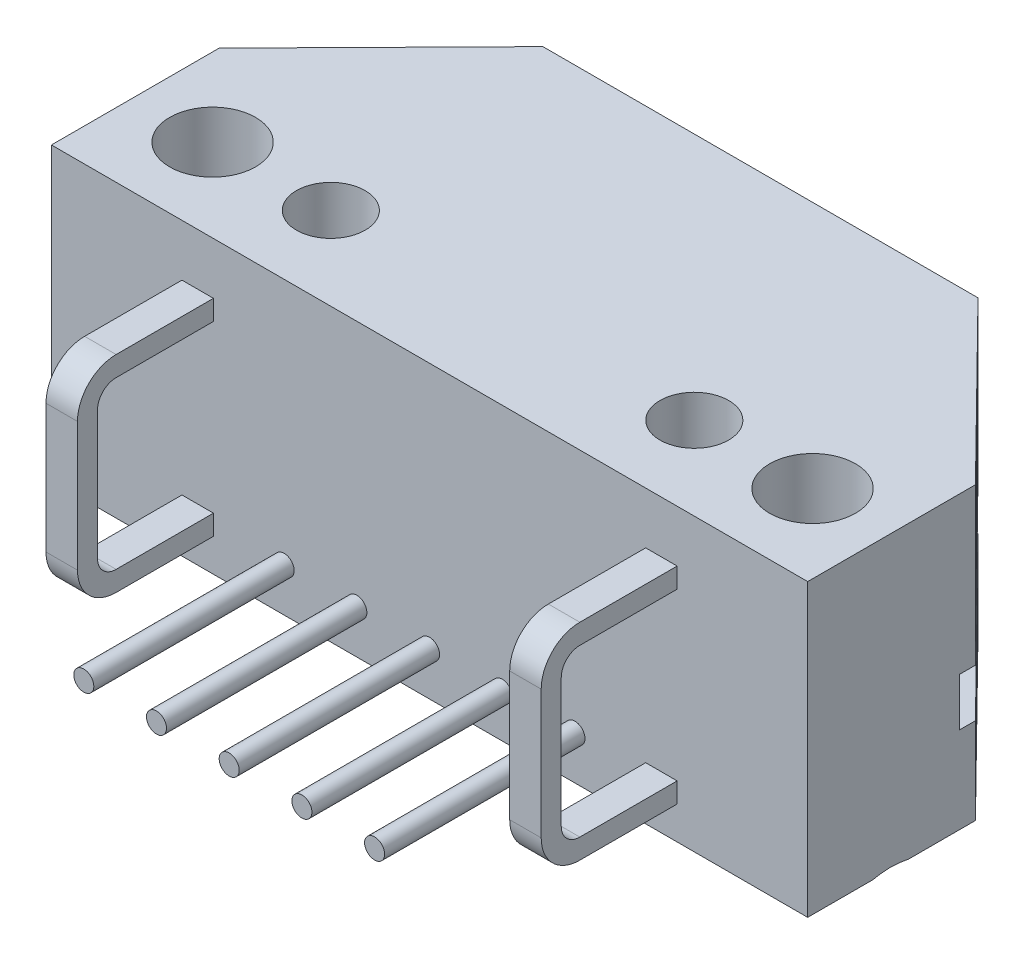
from build123d import *

# Parameters (mm, degrees)
AUFSATZ_LINEAR_AUSTRAGEN1_DEPTH                      = 6.74
AUFSATZ_LINEAR_AUSTRAGEN1_DEPTH_BACK                 = 3.42
SKIZZE1_R                                            = 1.385
SCHNITT_LINEAR_AUSTRAGEN1_DEPTH                      = 24.827593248
SCHNITT_LINEAR_AUSTRAGEN1_DEPTH_BACK                 = 24.827593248
SKIZZE2_W                                            = 16.035180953
SKIZZE2_H                                            = 1.68
SKIZZE3_R                                            = 1.2
SCHNITT_LINEAR_AUSTRAGEN2_DEPTH                      = 2.16
SKIZZE4_R                                            = 0.35
AUFSATZ_LINEAR_AUSTRAGEN2_DEPTH                      = 7
LINEAR_AUSTRAGEN_D_NN1_DEPTH                         = 0.55
FORMSENKUNG_F_R_M3_SENKSCHRAUBE_MIT_SCHL_D           = 3
FORMSENKUNG_F_R_M3_SENKSCHRAUBE_MIT_SCHL_DEPTH       = 11
FORMSENKUNG_F_R_M3_SENKSCHRAUBE_MIT_SCHL_CSINK_D     = 5.6
FORMSENKUNG_F_R_M3_SENKSCHRAUBE_MIT_SCHL_CSINK_ANGLE = 90
FORMSENKUNG_F_R_M3_SENKSCHRAUBE_MIT_SCHL_TIP         = 0.901290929


with BuildPart() as part:
    # Skizze1 → Aufsatz-Linear austragen1 (new, two sides: drawn at the far end of the back side and taken through both)
    with BuildSketch(Plane(origin=(0, 0, 0), x_dir=(1, 0, 0), z_dir=(0, 1, 0)).offset(-AUFSATZ_LINEAR_AUSTRAGEN1_DEPTH_BACK)):
        Polygon((-13.21, -18.65), (-13.21, -12.79), (-7.6, -7.09), (7.6, -7.09), (13.21, -12.79), (13.21, -18.65), align=None)
        with Locations(Location((-10.48, -15.75, 0), (0, 0, 270))):
            Circle(SKIZZE1_R, mode=Mode.SUBTRACT)
        with Locations(Location((10.48, -15.75, 0), (0, 0, 90))):
            Circle(SKIZZE1_R, mode=Mode.SUBTRACT)
    extrude(amount=AUFSATZ_LINEAR_AUSTRAGEN1_DEPTH + AUFSATZ_LINEAR_AUSTRAGEN1_DEPTH_BACK)

    # Skizze2 → Schnitt-Linear austragen1 (cut, two sides: drawn at the far end of the back side and taken through both)
    with BuildSketch(Plane(origin=(0, 0, 0), x_dir=(0, 0, -1), z_dir=(1, 0, 0)).offset(-SCHNITT_LINEAR_AUSTRAGEN1_DEPTH_BACK)):
        with Locations((-5.332409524, 0.44)):
            Rectangle(SKIZZE2_W, SKIZZE2_H)
    extrude(amount=SCHNITT_LINEAR_AUSTRAGEN1_DEPTH + SCHNITT_LINEAR_AUSTRAGEN1_DEPTH_BACK, mode=Mode.SUBTRACT)

    # Skizze3 → Schnitt-Linear austragen2 (cut)
    with BuildSketch(Plane(origin=(0, 6.74, 0), x_dir=(1, 0, 0), z_dir=(0, 1, 0))):
        with Locations(Location((6.35, -15.75, 0), (0, 0, 270))):
            Circle(SKIZZE3_R)
        with Locations(Location((-6.35, -15.75, 0), (0, 0, 90))):
            Circle(SKIZZE3_R)
    extrude(amount=-SCHNITT_LINEAR_AUSTRAGEN2_DEPTH, mode=Mode.SUBTRACT)

    # Skizze4 → Aufsatz-Linear austragen2 (add)
    with BuildSketch(Plane.XY.offset(18.65)):
        with Locations((0, -1.9)):
            Circle(SKIZZE4_R)
        with Locations((2.54, -1.9)):
            Circle(SKIZZE4_R)
        with Locations((5.08, -1.9)):
            Circle(SKIZZE4_R)
        with Locations(Location((-2.54, -1.9, 0), (0, 0, 180))):
            Circle(SKIZZE4_R)
        with Locations(Location((-5.08, -1.9, 0), (0, 0, 180))):
            Circle(SKIZZE4_R)
    extrude(amount=AUFSATZ_LINEAR_AUSTRAGEN2_DEPTH)

    # Skizze5 → Linear-Austragen-D_nn1 (add, symmetric)
    with BuildSketch(Plane(origin=(8.1, 0, 0), x_dir=(0, 0, -1), z_dir=(1, 0, 0))):
        with BuildLine():
            Line((-18.65, -1.57), (-22.05, -1.57))
            ThreePointArc((-22.05, -1.57), (-22.509619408, -1.379619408), (-22.7, -0.92))
            Line((-22.7, -0.92), (-22.7, 3.58))
            ThreePointArc((-22.7, 3.58), (-22.509619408, 4.039619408), (-22.05, 4.23))
            Line((-22.05, 4.23), (-18.65, 4.23))
            Line((-18.65, 4.23), (-18.65, 4.93))
            Line((-18.65, 4.93), (-22.05, 4.93))
            ThreePointArc((-22.05, 4.93), (-23.004594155, 4.534594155), (-23.4, 3.58))
            Line((-23.4, 3.58), (-23.4, -0.92))
            ThreePointArc((-23.4, -0.92), (-23.004594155, -1.874594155), (-22.05, -2.27))
            Line((-22.05, -2.27), (-18.65, -2.27))
            Line((-18.65, -2.27), (-18.65, -1.57))
        make_face()
    linear_austragen_d_nn1 = extrude(amount=LINEAR_AUSTRAGEN_D_NN1_DEPTH, both=True)

    # Spiegeln1: Linear-Austragen-D_nn1 across plane
    add(linear_austragen_d_nn1.mirror(Plane(origin=(0, 0, 0), x_dir=(0, 0, 1), z_dir=(1, 0, 0))))

    # Formsenkung f_r M3 Senkschraube mit Schl
    with Locations(Plane(origin=(0, -3.42, 0), x_dir=(-1, 0, 0), z_dir=(0, -1, 0))):
        with Locations((-10.48, -15.75), (10.48, -15.75)):
            CounterSinkHole(FORMSENKUNG_F_R_M3_SENKSCHRAUBE_MIT_SCHL_D / 2, FORMSENKUNG_F_R_M3_SENKSCHRAUBE_MIT_SCHL_CSINK_D / 2, depth=FORMSENKUNG_F_R_M3_SENKSCHRAUBE_MIT_SCHL_DEPTH, counter_sink_angle=FORMSENKUNG_F_R_M3_SENKSCHRAUBE_MIT_SCHL_CSINK_ANGLE)
            with Locations((0, 0, -(FORMSENKUNG_F_R_M3_SENKSCHRAUBE_MIT_SCHL_DEPTH + FORMSENKUNG_F_R_M3_SENKSCHRAUBE_MIT_SCHL_TIP / 2))):  # 118° drill point
                Cone(0, FORMSENKUNG_F_R_M3_SENKSCHRAUBE_MIT_SCHL_D / 2, FORMSENKUNG_F_R_M3_SENKSCHRAUBE_MIT_SCHL_TIP, mode=Mode.SUBTRACT)


solid = part.part
